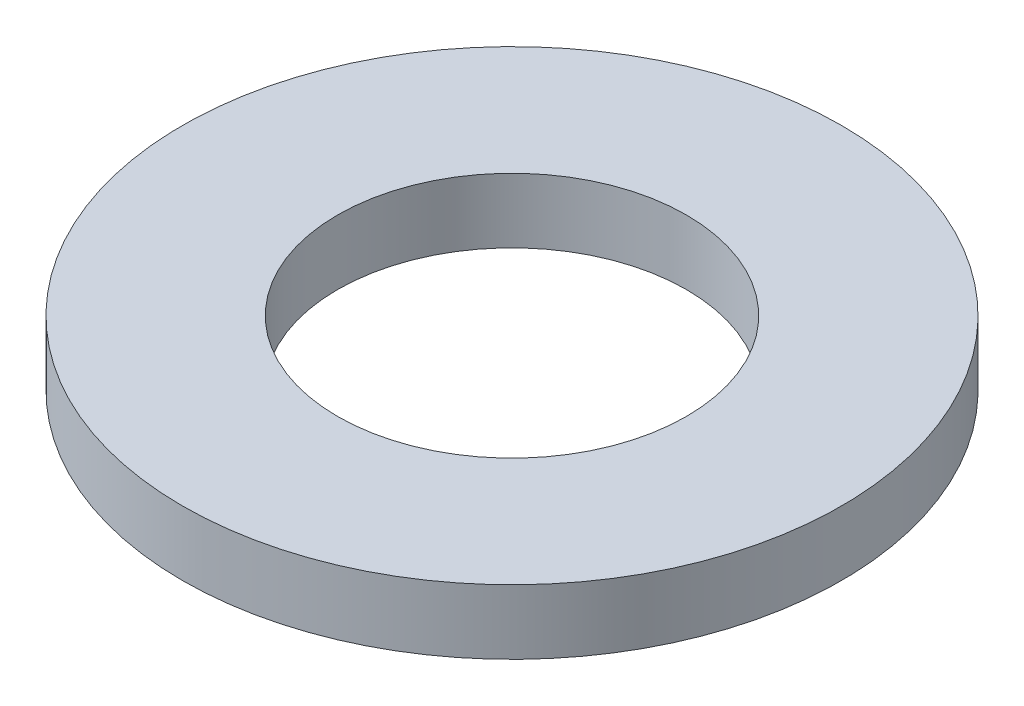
ISO-10303-21;
HEADER;
FILE_DESCRIPTION(('STEP AP214'),'2;1');
FILE_NAME('part.step','',(''),(''),'','','');
FILE_SCHEMA(('AUTOMOTIVE_DESIGN { 1 0 10303 214 1 1 1 1 }'));
ENDSEC;
DATA;
#1=APPLICATION_CONTEXT('core data for automotive mechanical design processes');
#2=APPLICATION_PROTOCOL_DEFINITION('international standard','automotive_design',2000,#1);
#3=PRODUCT_CONTEXT('',#1,'mechanical');
#4=PRODUCT('Part','Part','',(#3));
#5=PRODUCT_RELATED_PRODUCT_CATEGORY('part','',(#4));
#6=PRODUCT_DEFINITION_FORMATION('','',#4);
#7=PRODUCT_DEFINITION_CONTEXT('part definition',#1,'design');
#8=PRODUCT_DEFINITION('design','',#6,#7);
#9=PRODUCT_DEFINITION_SHAPE('','',#8);
#10=(LENGTH_UNIT() NAMED_UNIT(*) SI_UNIT(.MILLI.,.METRE.));
#11=(NAMED_UNIT(*) PLANE_ANGLE_UNIT() SI_UNIT($,.RADIAN.));
#12=(NAMED_UNIT(*) SI_UNIT($,.STERADIAN.) SOLID_ANGLE_UNIT());
#13=UNCERTAINTY_MEASURE_WITH_UNIT(LENGTH_MEASURE(1.E-05),#10,'distance_accuracy_value','');
#14=(GEOMETRIC_REPRESENTATION_CONTEXT(3) GLOBAL_UNCERTAINTY_ASSIGNED_CONTEXT((#13)) GLOBAL_UNIT_ASSIGNED_CONTEXT((#10,
#11,#12)) REPRESENTATION_CONTEXT('',''));
#15=CARTESIAN_POINT('',(0.,0.,0.));
#16=DIRECTION('',(0.,0.,1.));
#17=DIRECTION('',(1.,0.,0.));
#18=AXIS2_PLACEMENT_3D('',#15,#16,#17);
#19=CARTESIAN_POINT('',(0.,-0.5,0.));
#20=DIRECTION('',(0.,1.,0.));
#21=DIRECTION('',(0.,0.,1.));
#22=AXIS2_PLACEMENT_3D('',#19,#20,#21);
#23=PLANE('',#22);
#24=CARTESIAN_POINT('',(0.,-0.5,0.));
#25=DIRECTION('',(0.,1.,0.));
#26=DIRECTION('',(0.,0.,1.));
#27=AXIS2_PLACEMENT_3D('',#24,#25,#26);
#28=CIRCLE('',#27,1.35);
#29=CARTESIAN_POINT('',(0.,-0.5,1.35));
#30=VERTEX_POINT('',#29);
#31=EDGE_CURVE('E25',#30,#30,#28,.T.);
#32=ORIENTED_EDGE('',*,*,#31,.T.);
#33=EDGE_LOOP('',(#32));
#34=FACE_BOUND('',#33,.T.);
#35=CARTESIAN_POINT('',(0.,-0.5,0.));
#36=DIRECTION('',(0.,1.,0.));
#37=DIRECTION('',(0.,0.,1.));
#38=AXIS2_PLACEMENT_3D('',#35,#36,#37);
#39=CIRCLE('',#38,2.55);
#40=CARTESIAN_POINT('',(0.,-0.5,2.55));
#41=VERTEX_POINT('',#40);
#42=EDGE_CURVE('E16',#41,#41,#39,.T.);
#43=ORIENTED_EDGE('',*,*,#42,.F.);
#44=EDGE_LOOP('',(#43));
#45=FACE_BOUND('',#44,.T.);
#46=ADVANCED_FACE('F13',(#34,#45),#23,.F.);
#47=CARTESIAN_POINT('',(0.,-0.5,0.));
#48=DIRECTION('',(0.,1.,0.));
#49=DIRECTION('',(0.,0.,1.));
#50=AXIS2_PLACEMENT_3D('',#47,#48,#49);
#51=CYLINDRICAL_SURFACE('',#50,2.55);
#52=ORIENTED_EDGE('',*,*,#42,.T.);
#53=EDGE_LOOP('',(#52));
#54=FACE_BOUND('',#53,.T.);
#55=CARTESIAN_POINT('',(0.,0.,0.));
#56=DIRECTION('',(0.,1.,0.));
#57=DIRECTION('',(0.,0.,1.));
#58=AXIS2_PLACEMENT_3D('',#55,#56,#57);
#59=CIRCLE('',#58,2.55);
#60=CARTESIAN_POINT('',(0.,0.,2.55));
#61=VERTEX_POINT('',#60);
#62=EDGE_CURVE('E20',#61,#61,#59,.T.);
#63=ORIENTED_EDGE('',*,*,#62,.F.);
#64=EDGE_LOOP('',(#63));
#65=FACE_BOUND('',#64,.T.);
#66=ADVANCED_FACE('F33',(#54,#65),#51,.T.);
#67=CARTESIAN_POINT('',(0.,-0.6,0.));
#68=DIRECTION('',(0.,1.,0.));
#69=DIRECTION('',(0.,0.,1.));
#70=AXIS2_PLACEMENT_3D('',#67,#68,#69);
#71=CYLINDRICAL_SURFACE('',#70,1.35);
#72=ORIENTED_EDGE('',*,*,#31,.F.);
#73=EDGE_LOOP('',(#72));
#74=FACE_BOUND('',#73,.T.);
#75=CARTESIAN_POINT('',(0.,0.,0.));
#76=DIRECTION('',(0.,1.,0.));
#77=DIRECTION('',(0.,0.,1.));
#78=AXIS2_PLACEMENT_3D('',#75,#76,#77);
#79=CIRCLE('',#78,1.35);
#80=CARTESIAN_POINT('',(0.,0.,1.35));
#81=VERTEX_POINT('',#80);
#82=EDGE_CURVE('E8',#81,#81,#79,.F.);
#83=ORIENTED_EDGE('',*,*,#82,.F.);
#84=EDGE_LOOP('',(#83));
#85=FACE_BOUND('',#84,.T.);
#86=ADVANCED_FACE('F41',(#74,#85),#71,.F.);
#87=CARTESIAN_POINT('',(0.,0.,0.));
#88=DIRECTION('',(0.,1.,0.));
#89=DIRECTION('',(0.,0.,1.));
#90=AXIS2_PLACEMENT_3D('',#87,#88,#89);
#91=PLANE('',#90);
#92=ORIENTED_EDGE('',*,*,#82,.T.);
#93=EDGE_LOOP('',(#92));
#94=FACE_BOUND('',#93,.T.);
#95=ORIENTED_EDGE('',*,*,#62,.T.);
#96=EDGE_LOOP('',(#95));
#97=FACE_BOUND('',#96,.T.);
#98=ADVANCED_FACE('F42',(#94,#97),#91,.T.);
#99=CLOSED_SHELL('',(#46,#66,#86,#98));
#100=MANIFOLD_SOLID_BREP('B1',#99);
#101=ADVANCED_BREP_SHAPE_REPRESENTATION('',(#18,#100),#14);
#102=SHAPE_DEFINITION_REPRESENTATION(#9,#101);
ENDSEC;
END-ISO-10303-21;
